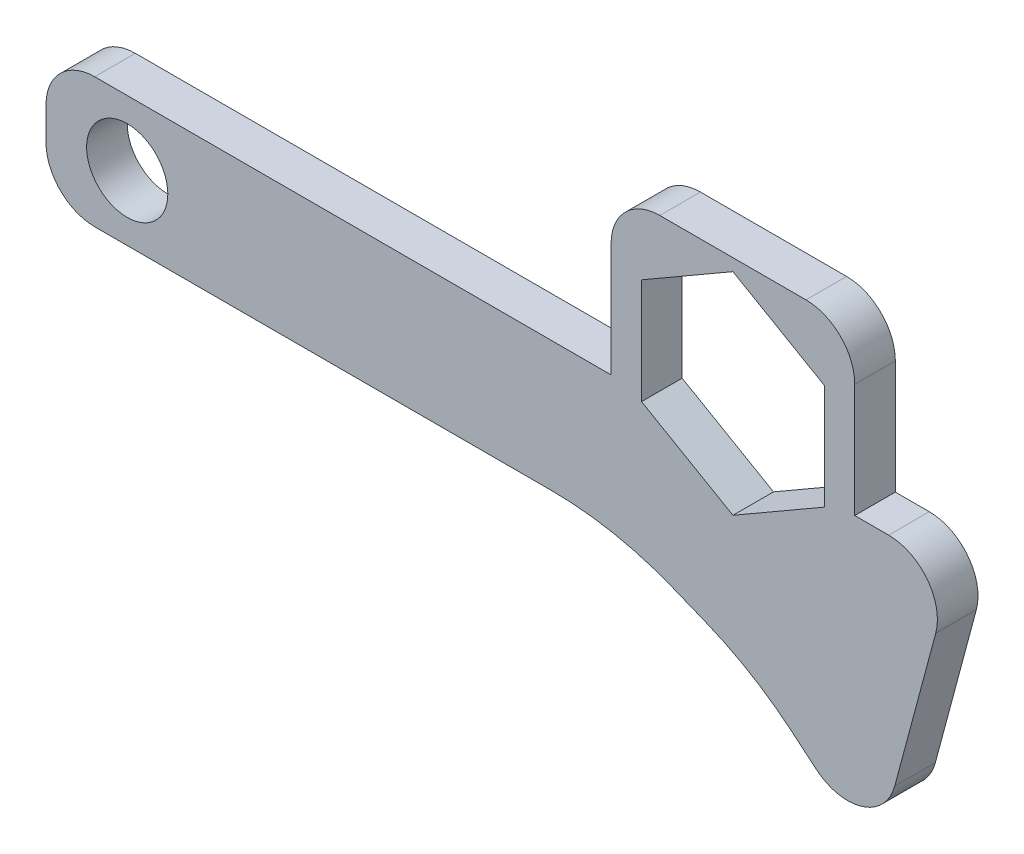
ISO-10303-21;
HEADER;
FILE_DESCRIPTION(('STEP AP214'),'2;1');
FILE_NAME('part.step','',(''),(''),'','','');
FILE_SCHEMA(('AUTOMOTIVE_DESIGN { 1 0 10303 214 1 1 1 1 }'));
ENDSEC;
DATA;
#1=APPLICATION_CONTEXT('core data for automotive mechanical design processes');
#2=APPLICATION_PROTOCOL_DEFINITION('international standard','automotive_design',2000,#1);
#3=PRODUCT_CONTEXT('',#1,'mechanical');
#4=PRODUCT('Part','Part','',(#3));
#5=PRODUCT_RELATED_PRODUCT_CATEGORY('part','',(#4));
#6=PRODUCT_DEFINITION_FORMATION('','',#4);
#7=PRODUCT_DEFINITION_CONTEXT('part definition',#1,'design');
#8=PRODUCT_DEFINITION('design','',#6,#7);
#9=PRODUCT_DEFINITION_SHAPE('','',#8);
#10=(LENGTH_UNIT() NAMED_UNIT(*) SI_UNIT(.MILLI.,.METRE.));
#11=(NAMED_UNIT(*) PLANE_ANGLE_UNIT() SI_UNIT($,.RADIAN.));
#12=(NAMED_UNIT(*) SI_UNIT($,.STERADIAN.) SOLID_ANGLE_UNIT());
#13=UNCERTAINTY_MEASURE_WITH_UNIT(LENGTH_MEASURE(1.E-05),#10,'distance_accuracy_value','');
#14=(GEOMETRIC_REPRESENTATION_CONTEXT(3) GLOBAL_UNCERTAINTY_ASSIGNED_CONTEXT((#13)) GLOBAL_UNIT_ASSIGNED_CONTEXT((#10,
#11,#12)) REPRESENTATION_CONTEXT('',''));
#15=CARTESIAN_POINT('',(0.,0.,0.));
#16=DIRECTION('',(0.,0.,1.));
#17=DIRECTION('',(1.,0.,0.));
#18=AXIS2_PLACEMENT_3D('',#15,#16,#17);
#19=CARTESIAN_POINT('',(0.,10.16,3.175));
#20=DIRECTION('',(0.,-1.,0.));
#21=DIRECTION('',(0.,0.,-1.));
#22=AXIS2_PLACEMENT_3D('',#19,#20,#21);
#23=PLANE('',#22);
#24=DIRECTION('',(-1.,0.,0.));
#25=VECTOR('',#24,1.);
#26=CARTESIAN_POINT('',(0.,10.16,3.175));
#27=LINE('',#26,#25);
#28=CARTESIAN_POINT('',(65.8908977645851,10.16,3.175));
#29=VERTEX_POINT('',#28);
#30=CARTESIAN_POINT('',(63.2361864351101,10.16,3.175));
#31=VERTEX_POINT('',#30);
#32=EDGE_CURVE('E278',#29,#31,#27,.T.);
#33=ORIENTED_EDGE('',*,*,#32,.F.);
#34=DIRECTION('',(0.,0.,-1.));
#35=VECTOR('',#34,1.);
#36=CARTESIAN_POINT('',(65.8908977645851,10.16,3.175));
#37=LINE('',#36,#35);
#38=CARTESIAN_POINT('',(65.8908977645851,10.16,0.));
#39=VERTEX_POINT('',#38);
#40=EDGE_CURVE('E363',#29,#39,#37,.T.);
#41=ORIENTED_EDGE('',*,*,#40,.T.);
#42=DIRECTION('',(-1.,0.,0.));
#43=VECTOR('',#42,1.);
#44=CARTESIAN_POINT('',(0.,10.16,0.));
#45=LINE('',#44,#43);
#46=CARTESIAN_POINT('',(63.2361864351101,10.16,0.));
#47=VERTEX_POINT('',#46);
#48=EDGE_CURVE('E284',#39,#47,#45,.T.);
#49=ORIENTED_EDGE('',*,*,#48,.T.);
#50=DIRECTION('',(0.,0.,-1.));
#51=VECTOR('',#50,1.);
#52=CARTESIAN_POINT('',(63.2361864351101,10.16,3.175));
#53=LINE('',#52,#51);
#54=EDGE_CURVE('E249',#31,#47,#53,.T.);
#55=ORIENTED_EDGE('',*,*,#54,.F.);
#56=EDGE_LOOP('',(#33,#41,#49,#55));
#57=FACE_BOUND('',#56,.T.);
#58=ADVANCED_FACE('F33',(#57),#23,.F.);
#59=CARTESIAN_POINT('',(0.,0.,3.175));
#60=DIRECTION('',(0.,0.,-1.));
#61=DIRECTION('',(-1.,0.,0.));
#62=AXIS2_PLACEMENT_3D('',#59,#60,#61);
#63=PLANE('',#62);
#64=DIRECTION('',(-0.866025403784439,0.5,0.));
#65=VECTOR('',#64,1.);
#66=CARTESIAN_POINT('',(60.8549364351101,17.7878721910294,3.175));
#67=LINE('',#66,#65);
#68=CARTESIAN_POINT('',(60.8549364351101,17.7878721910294,3.175));
#69=VERTEX_POINT('',#68);
#70=CARTESIAN_POINT('',(53.7111864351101,21.9123181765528,3.175));
#71=VERTEX_POINT('',#70);
#72=EDGE_CURVE('E226',#69,#71,#67,.T.);
#73=ORIENTED_EDGE('',*,*,#72,.F.);
#74=DIRECTION('',(0.,1.,0.));
#75=VECTOR('',#74,1.);
#76=CARTESIAN_POINT('',(60.8549364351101,9.53898021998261,3.175));
#77=LINE('',#76,#75);
#78=CARTESIAN_POINT('',(60.8549364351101,9.53898021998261,3.175));
#79=VERTEX_POINT('',#78);
#80=EDGE_CURVE('E48',#79,#69,#77,.T.);
#81=ORIENTED_EDGE('',*,*,#80,.F.);
#82=DIRECTION('',(0.866025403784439,0.5,0.));
#83=VECTOR('',#82,1.);
#84=CARTESIAN_POINT('',(53.7111864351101,5.41453423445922,3.175));
#85=LINE('',#84,#83);
#86=CARTESIAN_POINT('',(53.7111864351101,5.41453423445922,3.175));
#87=VERTEX_POINT('',#86);
#88=EDGE_CURVE('E212',#87,#79,#85,.T.);
#89=ORIENTED_EDGE('',*,*,#88,.F.);
#90=DIRECTION('',(0.866025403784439,-0.5,0.));
#91=VECTOR('',#90,1.);
#92=CARTESIAN_POINT('',(46.5674364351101,9.53898021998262,3.175));
#93=LINE('',#92,#91);
#94=CARTESIAN_POINT('',(46.5674364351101,9.53898021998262,3.175));
#95=VERTEX_POINT('',#94);
#96=EDGE_CURVE('E215',#95,#87,#93,.T.);
#97=ORIENTED_EDGE('',*,*,#96,.F.);
#98=DIRECTION('',(0.,-1.,0.));
#99=VECTOR('',#98,1.);
#100=CARTESIAN_POINT('',(46.5674364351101,17.7878721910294,3.175));
#101=LINE('',#100,#99);
#102=CARTESIAN_POINT('',(46.5674364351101,17.7878721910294,3.175));
#103=VERTEX_POINT('',#102);
#104=EDGE_CURVE('E231',#103,#95,#101,.T.);
#105=ORIENTED_EDGE('',*,*,#104,.F.);
#106=DIRECTION('',(-0.866025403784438,-0.5,0.));
#107=VECTOR('',#106,1.);
#108=CARTESIAN_POINT('',(53.7111864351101,21.9123181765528,3.175));
#109=LINE('',#108,#107);
#110=EDGE_CURVE('E228',#71,#103,#109,.T.);
#111=ORIENTED_EDGE('',*,*,#110,.F.);
#112=EDGE_LOOP('',(#73,#81,#89,#97,#105,#111));
#113=FACE_BOUND('',#112,.T.);
#114=DIRECTION('',(0.,1.,0.));
#115=VECTOR('',#114,1.);
#116=CARTESIAN_POINT('',(63.2361864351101,10.16,3.175));
#117=LINE('',#116,#115);
#118=CARTESIAN_POINT('',(63.2361864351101,19.05,3.175));
#119=VERTEX_POINT('',#118);
#120=EDGE_CURVE('E250',#31,#119,#117,.T.);
#121=ORIENTED_EDGE('',*,*,#120,.T.);
#122=CARTESIAN_POINT('',(59.4261864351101,19.05,3.175));
#123=DIRECTION('',(0.,0.,-1.));
#124=DIRECTION('',(-1.,0.,0.));
#125=AXIS2_PLACEMENT_3D('',#122,#123,#124);
#126=CIRCLE('',#125,3.81);
#127=CARTESIAN_POINT('',(59.4261864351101,22.86,3.175));
#128=VERTEX_POINT('',#127);
#129=EDGE_CURVE('E340',#119,#128,#126,.F.);
#130=ORIENTED_EDGE('',*,*,#129,.T.);
#131=DIRECTION('',(-1.,0.,0.));
#132=VECTOR('',#131,1.);
#133=CARTESIAN_POINT('',(44.1861864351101,22.86,3.175));
#134=LINE('',#133,#132);
#135=CARTESIAN_POINT('',(47.9961864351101,22.86,3.175));
#136=VERTEX_POINT('',#135);
#137=EDGE_CURVE('E246',#128,#136,#134,.T.);
#138=ORIENTED_EDGE('',*,*,#137,.T.);
#139=CARTESIAN_POINT('',(47.9961864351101,19.05,3.175));
#140=DIRECTION('',(0.,0.,-1.));
#141=DIRECTION('',(-1.,0.,0.));
#142=AXIS2_PLACEMENT_3D('',#139,#140,#141);
#143=CIRCLE('',#142,3.81);
#144=CARTESIAN_POINT('',(44.1861864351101,19.05,3.175));
#145=VERTEX_POINT('',#144);
#146=EDGE_CURVE('E338',#136,#145,#143,.F.);
#147=ORIENTED_EDGE('',*,*,#146,.T.);
#148=DIRECTION('',(0.,-1.,0.));
#149=VECTOR('',#148,1.);
#150=CARTESIAN_POINT('',(44.1861864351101,10.16,3.175));
#151=LINE('',#150,#149);
#152=CARTESIAN_POINT('',(44.1861864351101,10.16,3.175));
#153=VERTEX_POINT('',#152);
#154=EDGE_CURVE('E254',#145,#153,#151,.T.);
#155=ORIENTED_EDGE('',*,*,#154,.T.);
#156=CARTESIAN_POINT('',(3.81,10.16,3.175));
#157=VERTEX_POINT('',#156);
#158=EDGE_CURVE('E289',#153,#157,#27,.T.);
#159=ORIENTED_EDGE('',*,*,#158,.T.);
#160=CARTESIAN_POINT('',(3.81,6.35,3.175));
#161=DIRECTION('',(0.,0.,-1.));
#162=DIRECTION('',(-1.,0.,0.));
#163=AXIS2_PLACEMENT_3D('',#160,#161,#162);
#164=CIRCLE('',#163,3.81);
#165=CARTESIAN_POINT('',(0.,6.35,3.175));
#166=VERTEX_POINT('',#165);
#167=EDGE_CURVE('E332',#157,#166,#164,.F.);
#168=ORIENTED_EDGE('',*,*,#167,.T.);
#169=DIRECTION('',(0.,-1.,0.));
#170=VECTOR('',#169,1.);
#171=CARTESIAN_POINT('',(0.,0.,3.175));
#172=LINE('',#171,#170);
#173=CARTESIAN_POINT('',(0.,3.81,3.175));
#174=VERTEX_POINT('',#173);
#175=EDGE_CURVE('E307',#166,#174,#172,.T.);
#176=ORIENTED_EDGE('',*,*,#175,.T.);
#177=CARTESIAN_POINT('',(3.81,3.81,3.175));
#178=DIRECTION('',(0.,0.,-1.));
#179=DIRECTION('',(-1.,0.,0.));
#180=AXIS2_PLACEMENT_3D('',#177,#178,#179);
#181=CIRCLE('',#180,3.81);
#182=CARTESIAN_POINT('',(3.81,0.,3.175));
#183=VERTEX_POINT('',#182);
#184=EDGE_CURVE('E334',#174,#183,#181,.F.);
#185=ORIENTED_EDGE('',*,*,#184,.T.);
#186=DIRECTION('',(1.,0.,0.));
#187=VECTOR('',#186,1.);
#188=CARTESIAN_POINT('',(0.,0.,3.175));
#189=LINE('',#188,#187);
#190=CARTESIAN_POINT('',(39.512740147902,0.,3.175));
#191=VERTEX_POINT('',#190);
#192=EDGE_CURVE('E310',#183,#191,#189,.T.);
#193=ORIENTED_EDGE('',*,*,#192,.T.);
#194=CARTESIAN_POINT('',(39.512740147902,-25.4,3.175));
#195=DIRECTION('',(0.,0.,-1.));
#196=DIRECTION('',(-1.,0.,0.));
#197=AXIS2_PLACEMENT_3D('',#194,#195,#196);
#198=CIRCLE('',#197,25.4);
#199=CARTESIAN_POINT('',(49.0277476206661,-1.84953009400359,3.175));
#200=VERTEX_POINT('',#199);
#201=EDGE_CURVE('E378',#191,#200,#198,.T.);
#202=ORIENTED_EDGE('',*,*,#201,.T.);
#203=DIRECTION('',(0.927183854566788,-0.374606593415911,0.));
#204=VECTOR('',#203,1.);
#205=CARTESIAN_POINT('',(44.45,0.,3.175));
#206=LINE('',#205,#204);
#207=CARTESIAN_POINT('',(51.5531881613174,-2.86987430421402,3.175));
#208=VERTEX_POINT('',#207);
#209=EDGE_CURVE('E313',#200,#208,#206,.T.);
#210=ORIENTED_EDGE('',*,*,#209,.T.);
#211=CARTESIAN_POINT('',(42.0381806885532,-26.4203442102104,3.175));
#212=DIRECTION('',(0.,0.,-1.));
#213=DIRECTION('',(-1.,0.,0.));
#214=AXIS2_PLACEMENT_3D('',#211,#212,#213);
#215=CIRCLE('',#214,25.4);
#216=CARTESIAN_POINT('',(58.3649859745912,-6.96281535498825,3.175));
#217=VERTEX_POINT('',#216);
#218=EDGE_CURVE('E11',#208,#217,#215,.T.);
#219=ORIENTED_EDGE('',*,*,#218,.T.);
#220=DIRECTION('',(0.766044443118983,-0.642787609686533,0.));
#221=VECTOR('',#220,1.);
#222=CARTESIAN_POINT('',(64.8174052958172,-12.3770380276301,3.175));
#223=LINE('',#222,#221);
#224=CARTESIAN_POINT('',(60.2360749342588,-8.53284541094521,3.175));
#225=VERTEX_POINT('',#224);
#226=EDGE_CURVE('E316',#217,#225,#223,.T.);
#227=ORIENTED_EDGE('',*,*,#226,.T.);
#228=CARTESIAN_POINT('',(62.6850957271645,-5.61421608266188,3.175));
#229=DIRECTION('',(0.,0.,-1.));
#230=DIRECTION('',(-1.,0.,0.));
#231=AXIS2_PLACEMENT_3D('',#228,#229,#230);
#232=CIRCLE('',#231,3.81);
#233=CARTESIAN_POINT('',(66.3652731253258,-6.60031664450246,3.175));
#234=VERTEX_POINT('',#233);
#235=EDGE_CURVE('E336',#225,#234,#232,.F.);
#236=ORIENTED_EDGE('',*,*,#235,.T.);
#237=DIRECTION('',(0.258819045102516,0.96592582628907,0.));
#238=VECTOR('',#237,1.);
#239=CARTESIAN_POINT('',(64.8174052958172,-12.3770380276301,3.175));
#240=LINE('',#239,#238);
#241=CARTESIAN_POINT('',(69.5710751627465,5.36389943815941,3.175));
#242=VERTEX_POINT('',#241);
#243=EDGE_CURVE('E318',#234,#242,#240,.T.);
#244=ORIENTED_EDGE('',*,*,#243,.T.);
#245=CARTESIAN_POINT('',(65.8908977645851,6.35,3.175));
#246=DIRECTION('',(0.,0.,-1.));
#247=DIRECTION('',(-1.,0.,0.));
#248=AXIS2_PLACEMENT_3D('',#245,#246,#247);
#249=CIRCLE('',#248,3.81);
#250=EDGE_CURVE('E330',#242,#29,#249,.F.);
#251=ORIENTED_EDGE('',*,*,#250,.T.);
#252=ORIENTED_EDGE('',*,*,#32,.T.);
#253=EDGE_LOOP('',(#121,#130,#138,#147,#155,#159,#168,#176,#185,#193,#202,#210,#219,#227,#236,
#244,#251,#252));
#254=FACE_BOUND('',#253,.T.);
#255=CARTESIAN_POINT('',(6.35,5.08,3.175));
#256=DIRECTION('',(0.,0.,1.));
#257=DIRECTION('',(1.,0.,0.));
#258=AXIS2_PLACEMENT_3D('',#255,#256,#257);
#259=CIRCLE('',#258,3.175);
#260=CARTESIAN_POINT('',(9.525,5.08,3.175));
#261=VERTEX_POINT('',#260);
#262=EDGE_CURVE('E300',#261,#261,#259,.T.);
#263=ORIENTED_EDGE('',*,*,#262,.F.);
#264=EDGE_LOOP('',(#263));
#265=FACE_BOUND('',#264,.T.);
#266=ADVANCED_FACE('F398',(#113,#254,#265),#63,.F.);
#267=CARTESIAN_POINT('',(0.,0.,0.));
#268=DIRECTION('',(0.,0.,-1.));
#269=DIRECTION('',(-1.,0.,0.));
#270=AXIS2_PLACEMENT_3D('',#267,#268,#269);
#271=PLANE('',#270);
#272=DIRECTION('',(0.,1.,0.));
#273=VECTOR('',#272,1.);
#274=CARTESIAN_POINT('',(60.8549364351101,9.53898021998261,0.));
#275=LINE('',#274,#273);
#276=CARTESIAN_POINT('',(60.8549364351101,9.53898021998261,0.));
#277=VERTEX_POINT('',#276);
#278=CARTESIAN_POINT('',(60.8549364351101,17.7878721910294,0.));
#279=VERTEX_POINT('',#278);
#280=EDGE_CURVE('E195',#277,#279,#275,.T.);
#281=ORIENTED_EDGE('',*,*,#280,.T.);
#282=DIRECTION('',(-0.866025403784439,0.5,0.));
#283=VECTOR('',#282,1.);
#284=CARTESIAN_POINT('',(60.8549364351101,17.7878721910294,0.));
#285=LINE('',#284,#283);
#286=CARTESIAN_POINT('',(53.7111864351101,21.9123181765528,0.));
#287=VERTEX_POINT('',#286);
#288=EDGE_CURVE('E204',#279,#287,#285,.T.);
#289=ORIENTED_EDGE('',*,*,#288,.T.);
#290=DIRECTION('',(-0.866025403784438,-0.5,0.));
#291=VECTOR('',#290,1.);
#292=CARTESIAN_POINT('',(53.7111864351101,21.9123181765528,0.));
#293=LINE('',#292,#291);
#294=CARTESIAN_POINT('',(46.5674364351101,17.7878721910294,0.));
#295=VERTEX_POINT('',#294);
#296=EDGE_CURVE('E56',#287,#295,#293,.T.);
#297=ORIENTED_EDGE('',*,*,#296,.T.);
#298=DIRECTION('',(0.,-1.,0.));
#299=VECTOR('',#298,1.);
#300=CARTESIAN_POINT('',(46.5674364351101,17.7878721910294,0.));
#301=LINE('',#300,#299);
#302=CARTESIAN_POINT('',(46.5674364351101,9.53898021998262,0.));
#303=VERTEX_POINT('',#302);
#304=EDGE_CURVE('E219',#295,#303,#301,.T.);
#305=ORIENTED_EDGE('',*,*,#304,.T.);
#306=DIRECTION('',(0.866025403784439,-0.5,0.));
#307=VECTOR('',#306,1.);
#308=CARTESIAN_POINT('',(46.5674364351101,9.53898021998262,0.));
#309=LINE('',#308,#307);
#310=CARTESIAN_POINT('',(53.7111864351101,5.41453423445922,0.));
#311=VERTEX_POINT('',#310);
#312=EDGE_CURVE('E222',#303,#311,#309,.T.);
#313=ORIENTED_EDGE('',*,*,#312,.T.);
#314=DIRECTION('',(0.866025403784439,0.5,0.));
#315=VECTOR('',#314,1.);
#316=CARTESIAN_POINT('',(53.7111864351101,5.41453423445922,0.));
#317=LINE('',#316,#315);
#318=EDGE_CURVE('E201',#311,#277,#317,.T.);
#319=ORIENTED_EDGE('',*,*,#318,.T.);
#320=EDGE_LOOP('',(#281,#289,#297,#305,#313,#319));
#321=FACE_BOUND('',#320,.T.);
#322=DIRECTION('',(-1.,0.,0.));
#323=VECTOR('',#322,1.);
#324=CARTESIAN_POINT('',(44.1861864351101,22.86,0.));
#325=LINE('',#324,#323);
#326=CARTESIAN_POINT('',(59.4261864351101,22.86,0.));
#327=VERTEX_POINT('',#326);
#328=CARTESIAN_POINT('',(47.9961864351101,22.86,0.));
#329=VERTEX_POINT('',#328);
#330=EDGE_CURVE('E251',#327,#329,#325,.T.);
#331=ORIENTED_EDGE('',*,*,#330,.F.);
#332=CARTESIAN_POINT('',(59.4261864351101,19.05,0.));
#333=DIRECTION('',(0.,0.,-1.));
#334=DIRECTION('',(-1.,0.,0.));
#335=AXIS2_PLACEMENT_3D('',#332,#333,#334);
#336=CIRCLE('',#335,3.81);
#337=CARTESIAN_POINT('',(63.2361864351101,19.05,0.));
#338=VERTEX_POINT('',#337);
#339=EDGE_CURVE('E427',#327,#338,#336,.T.);
#340=ORIENTED_EDGE('',*,*,#339,.T.);
#341=DIRECTION('',(0.,1.,0.));
#342=VECTOR('',#341,1.);
#343=CARTESIAN_POINT('',(63.2361864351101,10.16,0.));
#344=LINE('',#343,#342);
#345=EDGE_CURVE('E255',#47,#338,#344,.T.);
#346=ORIENTED_EDGE('',*,*,#345,.F.);
#347=ORIENTED_EDGE('',*,*,#48,.F.);
#348=CARTESIAN_POINT('',(65.8908977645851,6.35,0.));
#349=DIRECTION('',(0.,0.,-1.));
#350=DIRECTION('',(-1.,0.,0.));
#351=AXIS2_PLACEMENT_3D('',#348,#349,#350);
#352=CIRCLE('',#351,3.81);
#353=CARTESIAN_POINT('',(69.5710751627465,5.36389943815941,0.));
#354=VERTEX_POINT('',#353);
#355=EDGE_CURVE('E281',#39,#354,#352,.T.);
#356=ORIENTED_EDGE('',*,*,#355,.T.);
#357=DIRECTION('',(0.258819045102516,0.96592582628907,0.));
#358=VECTOR('',#357,1.);
#359=CARTESIAN_POINT('',(64.8174052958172,-12.3770380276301,0.));
#360=LINE('',#359,#358);
#361=CARTESIAN_POINT('',(66.3652731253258,-6.60031664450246,0.));
#362=VERTEX_POINT('',#361);
#363=EDGE_CURVE('E414',#362,#354,#360,.T.);
#364=ORIENTED_EDGE('',*,*,#363,.F.);
#365=CARTESIAN_POINT('',(62.6850957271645,-5.61421608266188,0.));
#366=DIRECTION('',(0.,0.,-1.));
#367=DIRECTION('',(-1.,0.,0.));
#368=AXIS2_PLACEMENT_3D('',#365,#366,#367);
#369=CIRCLE('',#368,3.81);
#370=CARTESIAN_POINT('',(60.2360749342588,-8.53284541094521,0.));
#371=VERTEX_POINT('',#370);
#372=EDGE_CURVE('E431',#362,#371,#369,.T.);
#373=ORIENTED_EDGE('',*,*,#372,.T.);
#374=DIRECTION('',(0.766044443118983,-0.642787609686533,0.));
#375=VECTOR('',#374,1.);
#376=CARTESIAN_POINT('',(64.8174052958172,-12.3770380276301,0.));
#377=LINE('',#376,#375);
#378=CARTESIAN_POINT('',(58.3649859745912,-6.96281535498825,0.));
#379=VERTEX_POINT('',#378);
#380=EDGE_CURVE('E385',#379,#371,#377,.T.);
#381=ORIENTED_EDGE('',*,*,#380,.F.);
#382=CARTESIAN_POINT('',(42.0381806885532,-26.4203442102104,0.));
#383=DIRECTION('',(0.,0.,-1.));
#384=DIRECTION('',(-1.,0.,0.));
#385=AXIS2_PLACEMENT_3D('',#382,#383,#384);
#386=CIRCLE('',#385,25.4);
#387=CARTESIAN_POINT('',(51.5531881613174,-2.86987430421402,0.));
#388=VERTEX_POINT('',#387);
#389=EDGE_CURVE('E41',#379,#388,#386,.F.);
#390=ORIENTED_EDGE('',*,*,#389,.T.);
#391=DIRECTION('',(0.927183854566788,-0.374606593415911,0.));
#392=VECTOR('',#391,1.);
#393=CARTESIAN_POINT('',(44.45,0.,0.));
#394=LINE('',#393,#392);
#395=CARTESIAN_POINT('',(49.0277476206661,-1.84953009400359,0.));
#396=VERTEX_POINT('',#395);
#397=EDGE_CURVE('E383',#396,#388,#394,.T.);
#398=ORIENTED_EDGE('',*,*,#397,.F.);
#399=CARTESIAN_POINT('',(39.512740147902,-25.4,0.));
#400=DIRECTION('',(0.,0.,-1.));
#401=DIRECTION('',(-1.,0.,0.));
#402=AXIS2_PLACEMENT_3D('',#399,#400,#401);
#403=CIRCLE('',#402,25.4);
#404=CARTESIAN_POINT('',(39.512740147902,0.,0.));
#405=VERTEX_POINT('',#404);
#406=EDGE_CURVE('E376',#396,#405,#403,.F.);
#407=ORIENTED_EDGE('',*,*,#406,.T.);
#408=DIRECTION('',(1.,0.,0.));
#409=VECTOR('',#408,1.);
#410=CARTESIAN_POINT('',(0.,0.,0.));
#411=LINE('',#410,#409);
#412=CARTESIAN_POINT('',(3.81,0.,0.));
#413=VERTEX_POINT('',#412);
#414=EDGE_CURVE('E393',#413,#405,#411,.T.);
#415=ORIENTED_EDGE('',*,*,#414,.F.);
#416=CARTESIAN_POINT('',(3.81,3.81,0.));
#417=DIRECTION('',(0.,0.,-1.));
#418=DIRECTION('',(-1.,0.,0.));
#419=AXIS2_PLACEMENT_3D('',#416,#417,#418);
#420=CIRCLE('',#419,3.81);
#421=CARTESIAN_POINT('',(0.,3.81,0.));
#422=VERTEX_POINT('',#421);
#423=EDGE_CURVE('E435',#413,#422,#420,.T.);
#424=ORIENTED_EDGE('',*,*,#423,.T.);
#425=DIRECTION('',(0.,-1.,0.));
#426=VECTOR('',#425,1.);
#427=CARTESIAN_POINT('',(0.,0.,0.));
#428=LINE('',#427,#426);
#429=CARTESIAN_POINT('',(0.,6.35,0.));
#430=VERTEX_POINT('',#429);
#431=EDGE_CURVE('E305',#430,#422,#428,.T.);
#432=ORIENTED_EDGE('',*,*,#431,.F.);
#433=CARTESIAN_POINT('',(3.81,6.35,0.));
#434=DIRECTION('',(0.,0.,-1.));
#435=DIRECTION('',(-1.,0.,0.));
#436=AXIS2_PLACEMENT_3D('',#433,#434,#435);
#437=CIRCLE('',#436,3.81);
#438=CARTESIAN_POINT('',(3.81,10.16,0.));
#439=VERTEX_POINT('',#438);
#440=EDGE_CURVE('E437',#430,#439,#437,.T.);
#441=ORIENTED_EDGE('',*,*,#440,.T.);
#442=CARTESIAN_POINT('',(44.1861864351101,10.16,0.));
#443=VERTEX_POINT('',#442);
#444=EDGE_CURVE('E438',#443,#439,#45,.T.);
#445=ORIENTED_EDGE('',*,*,#444,.F.);
#446=DIRECTION('',(0.,-1.,0.));
#447=VECTOR('',#446,1.);
#448=CARTESIAN_POINT('',(44.1861864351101,10.16,0.));
#449=LINE('',#448,#447);
#450=CARTESIAN_POINT('',(44.1861864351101,19.05,0.));
#451=VERTEX_POINT('',#450);
#452=EDGE_CURVE('E238',#451,#443,#449,.T.);
#453=ORIENTED_EDGE('',*,*,#452,.F.);
#454=CARTESIAN_POINT('',(47.9961864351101,19.05,0.));
#455=DIRECTION('',(0.,0.,-1.));
#456=DIRECTION('',(-1.,0.,0.));
#457=AXIS2_PLACEMENT_3D('',#454,#455,#456);
#458=CIRCLE('',#457,3.81);
#459=EDGE_CURVE('E430',#451,#329,#458,.T.);
#460=ORIENTED_EDGE('',*,*,#459,.T.);
#461=EDGE_LOOP('',(#331,#340,#346,#347,#356,#364,#373,#381,#390,#398,#407,#415,#424,#432,#441,
#445,#453,#460));
#462=FACE_BOUND('',#461,.T.);
#463=CARTESIAN_POINT('',(6.35,5.08,0.));
#464=DIRECTION('',(0.,0.,1.));
#465=DIRECTION('',(1.,0.,0.));
#466=AXIS2_PLACEMENT_3D('',#463,#464,#465);
#467=CIRCLE('',#466,3.175);
#468=CARTESIAN_POINT('',(9.525,5.08,0.));
#469=VERTEX_POINT('',#468);
#470=EDGE_CURVE('E293',#469,#469,#467,.T.);
#471=ORIENTED_EDGE('',*,*,#470,.T.);
#472=EDGE_LOOP('',(#471));
#473=FACE_BOUND('',#472,.T.);
#474=ADVANCED_FACE('F208',(#321,#462,#473),#271,.T.);
#475=CARTESIAN_POINT('',(0.,0.,3.175));
#476=DIRECTION('',(1.,0.,0.));
#477=DIRECTION('',(0.,0.,-1.));
#478=AXIS2_PLACEMENT_3D('',#475,#476,#477);
#479=PLANE('',#478);
#480=ORIENTED_EDGE('',*,*,#431,.T.);
#481=DIRECTION('',(0.,0.,-1.));
#482=VECTOR('',#481,1.);
#483=CARTESIAN_POINT('',(0.,3.81,3.175));
#484=LINE('',#483,#482);
#485=EDGE_CURVE('E359',#422,#174,#484,.F.);
#486=ORIENTED_EDGE('',*,*,#485,.T.);
#487=ORIENTED_EDGE('',*,*,#175,.F.);
#488=DIRECTION('',(0.,0.,-1.));
#489=VECTOR('',#488,1.);
#490=CARTESIAN_POINT('',(0.,6.35,3.175));
#491=LINE('',#490,#489);
#492=EDGE_CURVE('E356',#166,#430,#491,.T.);
#493=ORIENTED_EDGE('',*,*,#492,.T.);
#494=EDGE_LOOP('',(#480,#486,#487,#493));
#495=FACE_BOUND('',#494,.T.);
#496=ADVANCED_FACE('F451',(#495),#479,.F.);
#497=CARTESIAN_POINT('',(0.,0.,3.175));
#498=DIRECTION('',(0.,1.,0.));
#499=DIRECTION('',(0.,0.,1.));
#500=AXIS2_PLACEMENT_3D('',#497,#498,#499);
#501=PLANE('',#500);
#502=ORIENTED_EDGE('',*,*,#414,.T.);
#503=DIRECTION('',(0.,0.,-1.));
#504=VECTOR('',#503,1.);
#505=CARTESIAN_POINT('',(39.512740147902,0.,3.175));
#506=LINE('',#505,#504);
#507=EDGE_CURVE('E371',#405,#191,#506,.F.);
#508=ORIENTED_EDGE('',*,*,#507,.T.);
#509=ORIENTED_EDGE('',*,*,#192,.F.);
#510=DIRECTION('',(0.,0.,-1.));
#511=VECTOR('',#510,1.);
#512=CARTESIAN_POINT('',(3.81,0.,3.175));
#513=LINE('',#512,#511);
#514=EDGE_CURVE('E353',#183,#413,#513,.T.);
#515=ORIENTED_EDGE('',*,*,#514,.T.);
#516=EDGE_LOOP('',(#502,#508,#509,#515));
#517=FACE_BOUND('',#516,.T.);
#518=ADVANCED_FACE('F460',(#517),#501,.F.);
#519=CARTESIAN_POINT('',(44.45,0.,3.175));
#520=DIRECTION('',(0.374606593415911,0.927183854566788,0.));
#521=DIRECTION('',(-0.927183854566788,0.374606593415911,0.));
#522=AXIS2_PLACEMENT_3D('',#519,#520,#521);
#523=PLANE('',#522);
#524=ORIENTED_EDGE('',*,*,#209,.F.);
#525=DIRECTION('',(0.,0.,-1.));
#526=VECTOR('',#525,1.);
#527=CARTESIAN_POINT('',(49.0277476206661,-1.84953009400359,0.));
#528=LINE('',#527,#526);
#529=EDGE_CURVE('E368',#200,#396,#528,.T.);
#530=ORIENTED_EDGE('',*,*,#529,.T.);
#531=ORIENTED_EDGE('',*,*,#397,.T.);
#532=DIRECTION('',(0.,0.,-1.));
#533=VECTOR('',#532,1.);
#534=CARTESIAN_POINT('',(51.5531881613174,-2.86987430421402,3.175));
#535=LINE('',#534,#533);
#536=EDGE_CURVE('E366',#388,#208,#535,.F.);
#537=ORIENTED_EDGE('',*,*,#536,.T.);
#538=EDGE_LOOP('',(#524,#530,#531,#537));
#539=FACE_BOUND('',#538,.T.);
#540=ADVANCED_FACE('F391',(#539),#523,.F.);
#541=CARTESIAN_POINT('',(64.8174052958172,-12.3770380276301,3.175));
#542=DIRECTION('',(0.642787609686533,0.766044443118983,0.));
#543=DIRECTION('',(-0.766044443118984,0.642787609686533,0.));
#544=AXIS2_PLACEMENT_3D('',#541,#542,#543);
#545=PLANE('',#544);
#546=ORIENTED_EDGE('',*,*,#226,.F.);
#547=DIRECTION('',(0.,0.,-1.));
#548=VECTOR('',#547,1.);
#549=CARTESIAN_POINT('',(58.3649859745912,-6.96281535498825,0.));
#550=LINE('',#549,#548);
#551=EDGE_CURVE('E373',#217,#379,#550,.T.);
#552=ORIENTED_EDGE('',*,*,#551,.T.);
#553=ORIENTED_EDGE('',*,*,#380,.T.);
#554=DIRECTION('',(0.,0.,-1.));
#555=VECTOR('',#554,1.);
#556=CARTESIAN_POINT('',(60.2360749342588,-8.53284541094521,3.175));
#557=LINE('',#556,#555);
#558=EDGE_CURVE('E350',#371,#225,#557,.F.);
#559=ORIENTED_EDGE('',*,*,#558,.T.);
#560=EDGE_LOOP('',(#546,#552,#553,#559));
#561=FACE_BOUND('',#560,.T.);
#562=ADVANCED_FACE('F401',(#561),#545,.F.);
#563=CARTESIAN_POINT('',(64.8174052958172,-12.3770380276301,3.175));
#564=DIRECTION('',(-0.96592582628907,0.258819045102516,0.));
#565=DIRECTION('',(-0.258819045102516,-0.96592582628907,0.));
#566=AXIS2_PLACEMENT_3D('',#563,#564,#565);
#567=PLANE('',#566);
#568=ORIENTED_EDGE('',*,*,#243,.F.);
#569=DIRECTION('',(0.,0.,-1.));
#570=VECTOR('',#569,1.);
#571=CARTESIAN_POINT('',(66.3652731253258,-6.60031664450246,3.175));
#572=LINE('',#571,#570);
#573=EDGE_CURVE('E347',#234,#362,#572,.T.);
#574=ORIENTED_EDGE('',*,*,#573,.T.);
#575=ORIENTED_EDGE('',*,*,#363,.T.);
#576=DIRECTION('',(0.,0.,-1.));
#577=VECTOR('',#576,1.);
#578=CARTESIAN_POINT('',(69.5710751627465,5.36389943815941,3.175));
#579=LINE('',#578,#577);
#580=EDGE_CURVE('E345',#354,#242,#579,.F.);
#581=ORIENTED_EDGE('',*,*,#580,.T.);
#582=EDGE_LOOP('',(#568,#574,#575,#581));
#583=FACE_BOUND('',#582,.T.);
#584=ADVANCED_FACE('F410',(#583),#567,.F.);
#585=ORIENTED_EDGE('',*,*,#444,.T.);
#586=DIRECTION('',(0.,0.,-1.));
#587=VECTOR('',#586,1.);
#588=CARTESIAN_POINT('',(3.81,10.16,3.175));
#589=LINE('',#588,#587);
#590=EDGE_CURVE('E361',#439,#157,#589,.F.);
#591=ORIENTED_EDGE('',*,*,#590,.T.);
#592=ORIENTED_EDGE('',*,*,#158,.F.);
#593=DIRECTION('',(0.,0.,-1.));
#594=VECTOR('',#593,1.);
#595=CARTESIAN_POINT('',(44.1861864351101,10.16,3.175));
#596=LINE('',#595,#594);
#597=EDGE_CURVE('E264',#153,#443,#596,.T.);
#598=ORIENTED_EDGE('',*,*,#597,.T.);
#599=EDGE_LOOP('',(#585,#591,#592,#598));
#600=FACE_BOUND('',#599,.T.);
#601=ADVANCED_FACE('F472',(#600),#23,.F.);
#602=CARTESIAN_POINT('',(6.35,5.08,3.175));
#603=DIRECTION('',(0.,0.,-1.));
#604=DIRECTION('',(-1.,0.,0.));
#605=AXIS2_PLACEMENT_3D('',#602,#603,#604);
#606=CYLINDRICAL_SURFACE('',#605,3.175);
#607=ORIENTED_EDGE('',*,*,#262,.T.);
#608=EDGE_LOOP('',(#607));
#609=FACE_BOUND('',#608,.T.);
#610=ORIENTED_EDGE('',*,*,#470,.F.);
#611=EDGE_LOOP('',(#610));
#612=FACE_BOUND('',#611,.T.);
#613=ADVANCED_FACE('F481',(#609,#612),#606,.F.);
#614=CARTESIAN_POINT('',(44.1861864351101,10.16,3.175));
#615=DIRECTION('',(1.,0.,0.));
#616=DIRECTION('',(0.,0.,-1.));
#617=AXIS2_PLACEMENT_3D('',#614,#615,#616);
#618=PLANE('',#617);
#619=ORIENTED_EDGE('',*,*,#154,.F.);
#620=DIRECTION('',(0.,0.,-1.));
#621=VECTOR('',#620,1.);
#622=CARTESIAN_POINT('',(44.1861864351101,19.05,3.175));
#623=LINE('',#622,#621);
#624=EDGE_CURVE('E342',#145,#451,#623,.T.);
#625=ORIENTED_EDGE('',*,*,#624,.T.);
#626=ORIENTED_EDGE('',*,*,#452,.T.);
#627=ORIENTED_EDGE('',*,*,#597,.F.);
#628=EDGE_LOOP('',(#619,#625,#626,#627));
#629=FACE_BOUND('',#628,.T.);
#630=ADVANCED_FACE('F486',(#629),#618,.F.);
#631=CARTESIAN_POINT('',(63.2361864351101,10.16,3.175));
#632=DIRECTION('',(-1.,0.,0.));
#633=DIRECTION('',(0.,0.,1.));
#634=AXIS2_PLACEMENT_3D('',#631,#632,#633);
#635=PLANE('',#634);
#636=ORIENTED_EDGE('',*,*,#345,.T.);
#637=DIRECTION('',(0.,0.,-1.));
#638=VECTOR('',#637,1.);
#639=CARTESIAN_POINT('',(63.2361864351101,19.05,3.175));
#640=LINE('',#639,#638);
#641=EDGE_CURVE('E327',#338,#119,#640,.F.);
#642=ORIENTED_EDGE('',*,*,#641,.T.);
#643=ORIENTED_EDGE('',*,*,#120,.F.);
#644=ORIENTED_EDGE('',*,*,#54,.T.);
#645=EDGE_LOOP('',(#636,#642,#643,#644));
#646=FACE_BOUND('',#645,.T.);
#647=ADVANCED_FACE('F425',(#646),#635,.F.);
#648=CARTESIAN_POINT('',(44.1861864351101,22.86,3.175));
#649=DIRECTION('',(0.,-1.,0.));
#650=DIRECTION('',(0.,0.,-1.));
#651=AXIS2_PLACEMENT_3D('',#648,#649,#650);
#652=PLANE('',#651);
#653=ORIENTED_EDGE('',*,*,#137,.F.);
#654=DIRECTION('',(0.,0.,-1.));
#655=VECTOR('',#654,1.);
#656=CARTESIAN_POINT('',(59.4261864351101,22.86,3.175));
#657=LINE('',#656,#655);
#658=EDGE_CURVE('E277',#128,#327,#657,.T.);
#659=ORIENTED_EDGE('',*,*,#658,.T.);
#660=ORIENTED_EDGE('',*,*,#330,.T.);
#661=DIRECTION('',(0.,0.,-1.));
#662=VECTOR('',#661,1.);
#663=CARTESIAN_POINT('',(47.9961864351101,22.86,3.175));
#664=LINE('',#663,#662);
#665=EDGE_CURVE('E275',#329,#136,#664,.F.);
#666=ORIENTED_EDGE('',*,*,#665,.T.);
#667=EDGE_LOOP('',(#653,#659,#660,#666));
#668=FACE_BOUND('',#667,.T.);
#669=ADVANCED_FACE('F502',(#668),#652,.F.);
#670=CARTESIAN_POINT('',(59.4261864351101,19.05,3.175));
#671=DIRECTION('',(0.,0.,-1.));
#672=DIRECTION('',(-1.,0.,0.));
#673=AXIS2_PLACEMENT_3D('',#670,#671,#672);
#674=CYLINDRICAL_SURFACE('',#673,3.81);
#675=ORIENTED_EDGE('',*,*,#129,.F.);
#676=ORIENTED_EDGE('',*,*,#641,.F.);
#677=ORIENTED_EDGE('',*,*,#339,.F.);
#678=ORIENTED_EDGE('',*,*,#658,.F.);
#679=EDGE_LOOP('',(#675,#676,#677,#678));
#680=FACE_BOUND('',#679,.T.);
#681=ADVANCED_FACE('F505',(#680),#674,.T.);
#682=CARTESIAN_POINT('',(47.9961864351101,19.05,3.175));
#683=DIRECTION('',(0.,0.,-1.));
#684=DIRECTION('',(-1.,0.,0.));
#685=AXIS2_PLACEMENT_3D('',#682,#683,#684);
#686=CYLINDRICAL_SURFACE('',#685,3.81);
#687=ORIENTED_EDGE('',*,*,#146,.F.);
#688=ORIENTED_EDGE('',*,*,#665,.F.);
#689=ORIENTED_EDGE('',*,*,#459,.F.);
#690=ORIENTED_EDGE('',*,*,#624,.F.);
#691=EDGE_LOOP('',(#687,#688,#689,#690));
#692=FACE_BOUND('',#691,.T.);
#693=ADVANCED_FACE('F503',(#692),#686,.T.);
#694=CARTESIAN_POINT('',(62.6850957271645,-5.61421608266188,3.175));
#695=DIRECTION('',(0.,0.,-1.));
#696=DIRECTION('',(-1.,0.,0.));
#697=AXIS2_PLACEMENT_3D('',#694,#695,#696);
#698=CYLINDRICAL_SURFACE('',#697,3.81);
#699=ORIENTED_EDGE('',*,*,#235,.F.);
#700=ORIENTED_EDGE('',*,*,#558,.F.);
#701=ORIENTED_EDGE('',*,*,#372,.F.);
#702=ORIENTED_EDGE('',*,*,#573,.F.);
#703=EDGE_LOOP('',(#699,#700,#701,#702));
#704=FACE_BOUND('',#703,.T.);
#705=ADVANCED_FACE('F406',(#704),#698,.T.);
#706=CARTESIAN_POINT('',(3.81,3.81,3.175));
#707=DIRECTION('',(0.,0.,-1.));
#708=DIRECTION('',(-1.,0.,0.));
#709=AXIS2_PLACEMENT_3D('',#706,#707,#708);
#710=CYLINDRICAL_SURFACE('',#709,3.81);
#711=ORIENTED_EDGE('',*,*,#184,.F.);
#712=ORIENTED_EDGE('',*,*,#485,.F.);
#713=ORIENTED_EDGE('',*,*,#423,.F.);
#714=ORIENTED_EDGE('',*,*,#514,.F.);
#715=EDGE_LOOP('',(#711,#712,#713,#714));
#716=FACE_BOUND('',#715,.T.);
#717=ADVANCED_FACE('F456',(#716),#710,.T.);
#718=CARTESIAN_POINT('',(3.81,6.35,3.175));
#719=DIRECTION('',(0.,0.,-1.));
#720=DIRECTION('',(-1.,0.,0.));
#721=AXIS2_PLACEMENT_3D('',#718,#719,#720);
#722=CYLINDRICAL_SURFACE('',#721,3.81);
#723=ORIENTED_EDGE('',*,*,#167,.F.);
#724=ORIENTED_EDGE('',*,*,#590,.F.);
#725=ORIENTED_EDGE('',*,*,#440,.F.);
#726=ORIENTED_EDGE('',*,*,#492,.F.);
#727=EDGE_LOOP('',(#723,#724,#725,#726));
#728=FACE_BOUND('',#727,.T.);
#729=ADVANCED_FACE('F468',(#728),#722,.T.);
#730=CARTESIAN_POINT('',(65.8908977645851,6.35,3.175));
#731=DIRECTION('',(0.,0.,-1.));
#732=DIRECTION('',(-1.,0.,0.));
#733=AXIS2_PLACEMENT_3D('',#730,#731,#732);
#734=CYLINDRICAL_SURFACE('',#733,3.81);
#735=ORIENTED_EDGE('',*,*,#250,.F.);
#736=ORIENTED_EDGE('',*,*,#580,.F.);
#737=ORIENTED_EDGE('',*,*,#355,.F.);
#738=ORIENTED_EDGE('',*,*,#40,.F.);
#739=EDGE_LOOP('',(#735,#736,#737,#738));
#740=FACE_BOUND('',#739,.T.);
#741=ADVANCED_FACE('F416',(#740),#734,.T.);
#742=CARTESIAN_POINT('',(39.512740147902,-25.4,3.175));
#743=DIRECTION('',(0.,0.,1.));
#744=DIRECTION('',(1.,0.,0.));
#745=AXIS2_PLACEMENT_3D('',#742,#743,#744);
#746=CYLINDRICAL_SURFACE('',#745,25.4);
#747=ORIENTED_EDGE('',*,*,#201,.F.);
#748=ORIENTED_EDGE('',*,*,#507,.F.);
#749=ORIENTED_EDGE('',*,*,#406,.F.);
#750=ORIENTED_EDGE('',*,*,#529,.F.);
#751=EDGE_LOOP('',(#747,#748,#749,#750));
#752=FACE_BOUND('',#751,.T.);
#753=ADVANCED_FACE('F462',(#752),#746,.F.);
#754=CARTESIAN_POINT('',(42.0381806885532,-26.4203442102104,3.175));
#755=DIRECTION('',(0.,0.,1.));
#756=DIRECTION('',(1.,0.,0.));
#757=AXIS2_PLACEMENT_3D('',#754,#755,#756);
#758=CYLINDRICAL_SURFACE('',#757,25.4);
#759=ORIENTED_EDGE('',*,*,#218,.F.);
#760=ORIENTED_EDGE('',*,*,#536,.F.);
#761=ORIENTED_EDGE('',*,*,#389,.F.);
#762=ORIENTED_EDGE('',*,*,#551,.F.);
#763=EDGE_LOOP('',(#759,#760,#761,#762));
#764=FACE_BOUND('',#763,.T.);
#765=ADVANCED_FACE('F35',(#764),#758,.F.);
#766=CARTESIAN_POINT('',(60.8549364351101,9.53898021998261,0.));
#767=DIRECTION('',(1.,0.,0.));
#768=DIRECTION('',(0.,0.,-1.));
#769=AXIS2_PLACEMENT_3D('',#766,#767,#768);
#770=PLANE('',#769);
#771=ORIENTED_EDGE('',*,*,#80,.T.);
#772=DIRECTION('',(0.,0.,1.));
#773=VECTOR('',#772,1.);
#774=CARTESIAN_POINT('',(60.8549364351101,17.7878721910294,0.));
#775=LINE('',#774,#773);
#776=EDGE_CURVE('E191',#279,#69,#775,.T.);
#777=ORIENTED_EDGE('',*,*,#776,.F.);
#778=ORIENTED_EDGE('',*,*,#280,.F.);
#779=DIRECTION('',(0.,0.,1.));
#780=VECTOR('',#779,1.);
#781=CARTESIAN_POINT('',(60.8549364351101,9.53898021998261,0.));
#782=LINE('',#781,#780);
#783=EDGE_CURVE('E236',#277,#79,#782,.T.);
#784=ORIENTED_EDGE('',*,*,#783,.T.);
#785=EDGE_LOOP('',(#771,#777,#778,#784));
#786=FACE_BOUND('',#785,.T.);
#787=ADVANCED_FACE('F193',(#786),#770,.F.);
#788=CARTESIAN_POINT('',(53.7111864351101,5.41453423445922,0.));
#789=DIRECTION('',(0.5,-0.866025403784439,0.));
#790=DIRECTION('',(0.866025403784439,0.5,0.));
#791=AXIS2_PLACEMENT_3D('',#788,#789,#790);
#792=PLANE('',#791);
#793=ORIENTED_EDGE('',*,*,#88,.T.);
#794=ORIENTED_EDGE('',*,*,#783,.F.);
#795=ORIENTED_EDGE('',*,*,#318,.F.);
#796=DIRECTION('',(0.,0.,1.));
#797=VECTOR('',#796,1.);
#798=CARTESIAN_POINT('',(53.7111864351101,5.41453423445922,0.));
#799=LINE('',#798,#797);
#800=EDGE_CURVE('E239',#311,#87,#799,.T.);
#801=ORIENTED_EDGE('',*,*,#800,.T.);
#802=EDGE_LOOP('',(#793,#794,#795,#801));
#803=FACE_BOUND('',#802,.T.);
#804=ADVANCED_FACE('F589',(#803),#792,.F.);
#805=CARTESIAN_POINT('',(46.5674364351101,9.53898021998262,0.));
#806=DIRECTION('',(-0.5,-0.866025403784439,0.));
#807=DIRECTION('',(0.866025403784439,-0.5,0.));
#808=AXIS2_PLACEMENT_3D('',#805,#806,#807);
#809=PLANE('',#808);
#810=ORIENTED_EDGE('',*,*,#96,.T.);
#811=ORIENTED_EDGE('',*,*,#800,.F.);
#812=ORIENTED_EDGE('',*,*,#312,.F.);
#813=DIRECTION('',(0.,0.,1.));
#814=VECTOR('',#813,1.);
#815=CARTESIAN_POINT('',(46.5674364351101,9.53898021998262,0.));
#816=LINE('',#815,#814);
#817=EDGE_CURVE('E241',#303,#95,#816,.T.);
#818=ORIENTED_EDGE('',*,*,#817,.T.);
#819=EDGE_LOOP('',(#810,#811,#812,#818));
#820=FACE_BOUND('',#819,.T.);
#821=ADVANCED_FACE('F598',(#820),#809,.F.);
#822=CARTESIAN_POINT('',(46.5674364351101,17.7878721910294,0.));
#823=DIRECTION('',(-1.,0.,0.));
#824=DIRECTION('',(0.,0.,1.));
#825=AXIS2_PLACEMENT_3D('',#822,#823,#824);
#826=PLANE('',#825);
#827=ORIENTED_EDGE('',*,*,#104,.T.);
#828=ORIENTED_EDGE('',*,*,#817,.F.);
#829=ORIENTED_EDGE('',*,*,#304,.F.);
#830=DIRECTION('',(0.,0.,1.));
#831=VECTOR('',#830,1.);
#832=CARTESIAN_POINT('',(46.5674364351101,17.7878721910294,0.));
#833=LINE('',#832,#831);
#834=EDGE_CURVE('E243',#295,#103,#833,.T.);
#835=ORIENTED_EDGE('',*,*,#834,.T.);
#836=EDGE_LOOP('',(#827,#828,#829,#835));
#837=FACE_BOUND('',#836,.T.);
#838=ADVANCED_FACE('F608',(#837),#826,.F.);
#839=CARTESIAN_POINT('',(53.7111864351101,21.9123181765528,0.));
#840=DIRECTION('',(-0.5,0.866025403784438,0.));
#841=DIRECTION('',(-0.866025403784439,-0.5,0.));
#842=AXIS2_PLACEMENT_3D('',#839,#840,#841);
#843=PLANE('',#842);
#844=ORIENTED_EDGE('',*,*,#110,.T.);
#845=ORIENTED_EDGE('',*,*,#834,.F.);
#846=ORIENTED_EDGE('',*,*,#296,.F.);
#847=DIRECTION('',(0.,0.,1.));
#848=VECTOR('',#847,1.);
#849=CARTESIAN_POINT('',(53.7111864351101,21.9123181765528,0.));
#850=LINE('',#849,#848);
#851=EDGE_CURVE('E200',#287,#71,#850,.T.);
#852=ORIENTED_EDGE('',*,*,#851,.T.);
#853=EDGE_LOOP('',(#844,#845,#846,#852));
#854=FACE_BOUND('',#853,.T.);
#855=ADVANCED_FACE('F618',(#854),#843,.F.);
#856=CARTESIAN_POINT('',(60.8549364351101,17.7878721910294,0.));
#857=DIRECTION('',(0.5,0.866025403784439,0.));
#858=DIRECTION('',(-0.866025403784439,0.5,0.));
#859=AXIS2_PLACEMENT_3D('',#856,#857,#858);
#860=PLANE('',#859);
#861=ORIENTED_EDGE('',*,*,#72,.T.);
#862=ORIENTED_EDGE('',*,*,#851,.F.);
#863=ORIENTED_EDGE('',*,*,#288,.F.);
#864=ORIENTED_EDGE('',*,*,#776,.T.);
#865=EDGE_LOOP('',(#861,#862,#863,#864));
#866=FACE_BOUND('',#865,.T.);
#867=ADVANCED_FACE('F205',(#866),#860,.F.);
#868=CLOSED_SHELL('',(#58,#266,#474,#496,#518,#540,#562,#584,#601,#613,#630,#647,#669,#681,#693,
#705,#717,#729,#741,#753,#765,#787,#804,#821,#838,#855,#867));
#869=MANIFOLD_SOLID_BREP('B2',#868);
#870=ADVANCED_BREP_SHAPE_REPRESENTATION('',(#18,#869),#14);
#871=SHAPE_DEFINITION_REPRESENTATION(#9,#870);
ENDSEC;
END-ISO-10303-21;
